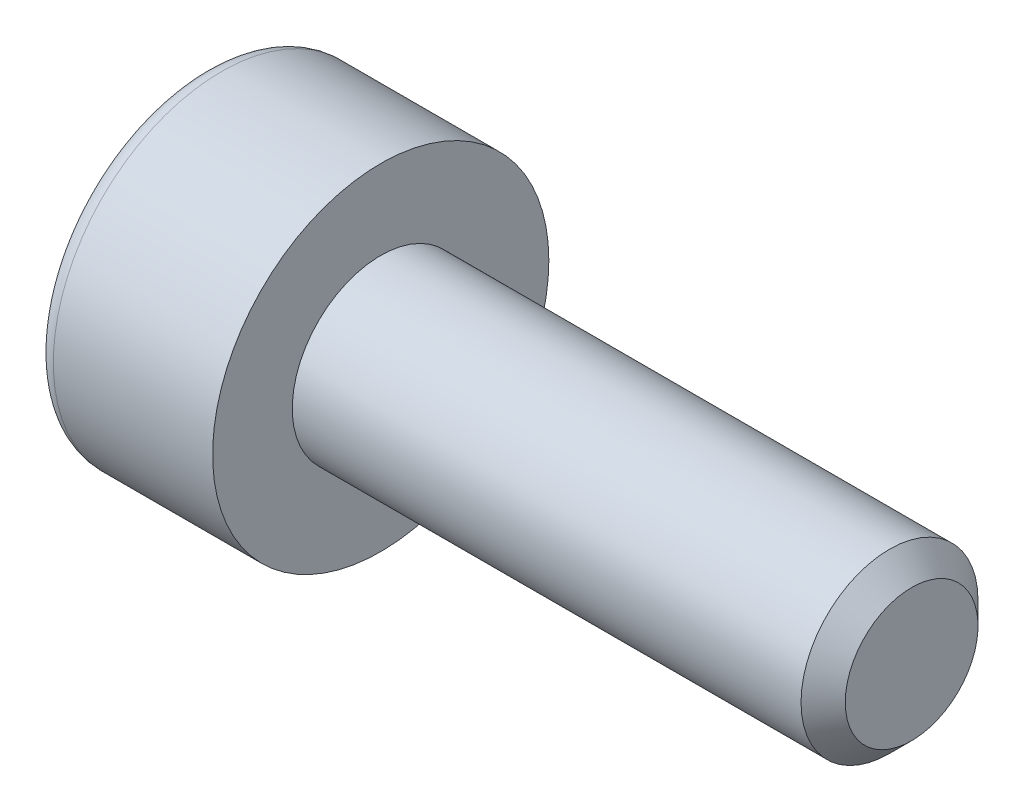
ISO-10303-21;
HEADER;
FILE_DESCRIPTION(('STEP AP214'),'2;1');
FILE_NAME('part.step','',(''),(''),'','','');
FILE_SCHEMA(('AUTOMOTIVE_DESIGN { 1 0 10303 214 1 1 1 1 }'));
ENDSEC;
DATA;
#1=APPLICATION_CONTEXT('core data for automotive mechanical design processes');
#2=APPLICATION_PROTOCOL_DEFINITION('international standard','automotive_design',2000,#1);
#3=PRODUCT_CONTEXT('',#1,'mechanical');
#4=PRODUCT('Part','Part','',(#3));
#5=PRODUCT_RELATED_PRODUCT_CATEGORY('part','',(#4));
#6=PRODUCT_DEFINITION_FORMATION('','',#4);
#7=PRODUCT_DEFINITION_CONTEXT('part definition',#1,'design');
#8=PRODUCT_DEFINITION('design','',#6,#7);
#9=PRODUCT_DEFINITION_SHAPE('','',#8);
#10=(LENGTH_UNIT() NAMED_UNIT(*) SI_UNIT(.MILLI.,.METRE.));
#11=(NAMED_UNIT(*) PLANE_ANGLE_UNIT() SI_UNIT($,.RADIAN.));
#12=(NAMED_UNIT(*) SI_UNIT($,.STERADIAN.) SOLID_ANGLE_UNIT());
#13=UNCERTAINTY_MEASURE_WITH_UNIT(LENGTH_MEASURE(1.E-05),#10,'distance_accuracy_value','');
#14=(GEOMETRIC_REPRESENTATION_CONTEXT(3) GLOBAL_UNCERTAINTY_ASSIGNED_CONTEXT((#13)) GLOBAL_UNIT_ASSIGNED_CONTEXT((#10,
#11,#12)) REPRESENTATION_CONTEXT('',''));
#15=CARTESIAN_POINT('',(0.,0.,0.));
#16=DIRECTION('',(0.,0.,1.));
#17=DIRECTION('',(1.,0.,0.));
#18=AXIS2_PLACEMENT_3D('',#15,#16,#17);
#19=CARTESIAN_POINT('',(-0.549999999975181,0.,0.));
#20=DIRECTION('',(-1.,0.,0.));
#21=DIRECTION('',(0.,0.,1.));
#22=AXIS2_PLACEMENT_3D('',#19,#20,#21);
#23=CONICAL_SURFACE('',#22,0.714285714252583,1.04719755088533);
#24=CARTESIAN_POINT('',(-0.13760695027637,0.,7.0082828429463E-12));
#25=VERTEX_POINT('',#24);
#26=VERTEX_LOOP('',#25);
#27=FACE_BOUND('',#26,.T.);
#28=CARTESIAN_POINT('',(-0.549999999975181,0.,0.));
#29=DIRECTION('',(-1.,0.,0.));
#30=DIRECTION('',(0.,0.,1.));
#31=AXIS2_PLACEMENT_3D('',#28,#29,#30);
#32=CIRCLE('',#31,0.714285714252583);
#33=CARTESIAN_POINT('',(-0.549999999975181,0.,0.714285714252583));
#34=VERTEX_POINT('',#33);
#35=EDGE_CURVE('E239',#34,#34,#32,.T.);
#36=ORIENTED_EDGE('',*,*,#35,.T.);
#37=EDGE_LOOP('',(#36));
#38=FACE_BOUND('',#37,.T.);
#39=ADVANCED_FACE('F17',(#27,#38),#23,.F.);
#40=CARTESIAN_POINT('',(-0.55,0.430125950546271,0.745));
#41=DIRECTION('',(0.,0.,1.));
#42=DIRECTION('',(1.,0.,0.));
#43=AXIS2_PLACEMENT_3D('',#40,#41,#42);
#44=PLANE('',#43);
#45=DIRECTION('',(1.,0.,0.));
#46=VECTOR('',#45,1.);
#47=CARTESIAN_POINT('',(-0.55,-0.430125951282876,0.744999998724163));
#48=LINE('',#47,#46);
#49=CARTESIAN_POINT('',(-0.55,-0.430125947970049,0.745000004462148));
#50=VERTEX_POINT('',#49);
#51=CARTESIAN_POINT('',(-1.99525190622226,-0.430125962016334,0.744999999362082));
#52=VERTEX_POINT('',#51);
#53=EDGE_CURVE('E231',#50,#52,#48,.F.);
#54=ORIENTED_EDGE('',*,*,#53,.T.);
#55=CARTESIAN_POINT('',(-1.87999999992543,0.,0.745));
#56=CARTESIAN_POINT('',(-1.87998385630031,-0.0228913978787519,0.745));
#57=CARTESIAN_POINT('',(-1.88105575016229,-0.0457651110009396,0.745));
#58=CARTESIAN_POINT('',(-1.88523402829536,-0.091286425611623,0.745));
#59=CARTESIAN_POINT('',(-1.88833675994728,-0.113934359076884,0.745));
#60=CARTESIAN_POINT('',(-1.90035941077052,-0.180676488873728,0.745));
#61=CARTESIAN_POINT('',(-1.91200287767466,-0.224290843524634,0.745));
#62=CARTESIAN_POINT('',(-1.93576731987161,-0.294788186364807,0.745));
#63=CARTESIAN_POINT('',(-1.9463278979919,-0.322236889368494,0.745));
#64=CARTESIAN_POINT('',(-1.96942771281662,-0.376627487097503,0.745));
#65=CARTESIAN_POINT('',(-1.98198614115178,-0.403561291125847,0.745));
#66=CARTESIAN_POINT('',(-1.99525191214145,-0.430125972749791,0.745));
#67=B_SPLINE_CURVE_WITH_KNOTS('',3,(#55,#56,#57,#58,#59,#60,#61,#62,#63,#64,#65,#66),
.UNSPECIFIED.,.F.,.F.,(4,2,2,2,2,4),(0.,0.0686183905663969,0.137113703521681,0.271967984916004,
0.360142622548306,0.449222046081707),.UNSPECIFIED.);
#68=CARTESIAN_POINT('',(-1.87999999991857,0.,0.744999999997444));
#69=VERTEX_POINT('',#68);
#70=EDGE_CURVE('E100',#69,#52,#67,.T.);
#71=ORIENTED_EDGE('',*,*,#70,.F.);
#72=CARTESIAN_POINT('',(-1.99525189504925,0.430125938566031,0.745));
#73=CARTESIAN_POINT('',(-1.98038788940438,0.400369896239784,0.745));
#74=CARTESIAN_POINT('',(-1.966402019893,0.370110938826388,0.745));
#75=CARTESIAN_POINT('',(-1.94080866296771,0.308386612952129,0.745));
#76=CARTESIAN_POINT('',(-1.92921687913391,0.276914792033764,0.745));
#77=CARTESIAN_POINT('',(-1.90953137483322,0.213872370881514,0.745));
#78=CARTESIAN_POINT('',(-1.90134578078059,0.182331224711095,0.745));
#79=CARTESIAN_POINT('',(-1.888734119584,0.118572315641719,0.745));
#80=CARTESIAN_POINT('',(-1.88429656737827,0.0863569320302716,0.745));
#81=CARTESIAN_POINT('',(-1.88130604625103,0.0450415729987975,0.745));
#82=CARTESIAN_POINT('',(-1.88081800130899,0.0360620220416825,0.745));
#83=CARTESIAN_POINT('',(-1.88016446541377,0.0180555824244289,0.745));
#84=CARTESIAN_POINT('',(-1.88000025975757,0.00902864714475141,0.745));
#85=CARTESIAN_POINT('',(-1.87999999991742,0.,0.745));
#86=B_SPLINE_CURVE_WITH_KNOTS('',3,(#72,#73,#74,#75,#76,#77,#78,#79,#80,#81,#82,#83,#84,#85),
.UNSPECIFIED.,.F.,.F.,(4,2,2,2,2,2,4),(0.,0.0998595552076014,0.200354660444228,
0.297929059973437,0.395203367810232,0.422177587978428,0.449258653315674),.UNSPECIFIED.);
#87=CARTESIAN_POINT('',(-1.99525190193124,0.43012594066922,0.745000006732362));
#88=VERTEX_POINT('',#87);
#89=EDGE_CURVE('E94',#88,#69,#86,.T.);
#90=ORIENTED_EDGE('',*,*,#89,.F.);
#91=DIRECTION('',(1.,0.,0.));
#92=VECTOR('',#91,1.);
#93=CARTESIAN_POINT('',(-0.55,0.430125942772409,0.745000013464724));
#94=LINE('',#93,#92);
#95=CARTESIAN_POINT('',(-0.55,0.430125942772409,0.745000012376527));
#96=VERTEX_POINT('',#95);
#97=EDGE_CURVE('E98',#88,#96,#94,.T.);
#98=ORIENTED_EDGE('',*,*,#97,.T.);
#99=DIRECTION('',(0.,1.,0.));
#100=VECTOR('',#99,1.);
#101=CARTESIAN_POINT('',(-0.55,0.,0.745000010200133));
#102=LINE('',#101,#100);
#103=EDGE_CURVE('E232',#96,#50,#102,.F.);
#104=ORIENTED_EDGE('',*,*,#103,.T.);
#105=EDGE_LOOP('',(#54,#71,#90,#98,#104));
#106=FACE_BOUND('',#105,.T.);
#107=ADVANCED_FACE('F97',(#106),#44,.F.);
#108=CARTESIAN_POINT('',(-0.55,0.,0.));
#109=DIRECTION('',(1.,0.,0.));
#110=DIRECTION('',(0.,0.,-1.));
#111=AXIS2_PLACEMENT_3D('',#108,#109,#110);
#112=PLANE('',#111);
#113=DIRECTION('',(0.,1.,0.));
#114=VECTOR('',#113,1.);
#115=CARTESIAN_POINT('',(-0.55,-0.430125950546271,-0.745));
#116=LINE('',#115,#114);
#117=CARTESIAN_POINT('',(-0.55,0.430125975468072,-0.744999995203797));
#118=VERTEX_POINT('',#117);
#119=CARTESIAN_POINT('',(-0.55,-0.430125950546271,-0.745));
#120=VERTEX_POINT('',#119);
#121=EDGE_CURVE('E222',#118,#120,#116,.F.);
#122=ORIENTED_EDGE('',*,*,#121,.T.);
#123=DIRECTION('',(0.,0.5,-0.866025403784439));
#124=VECTOR('',#123,1.);
#125=CARTESIAN_POINT('',(-0.55,-0.860251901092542,0.));
#126=LINE('',#125,#124);
#127=CARTESIAN_POINT('',(-0.55,-0.860251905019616,-6.81134989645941E-09));
#128=VERTEX_POINT('',#127);
#129=EDGE_CURVE('E229',#120,#128,#126,.F.);
#130=ORIENTED_EDGE('',*,*,#129,.T.);
#131=DIRECTION('',(0.,-0.5,-0.866025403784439));
#132=VECTOR('',#131,1.);
#133=CARTESIAN_POINT('',(-0.55,-0.430125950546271,0.745));
#134=LINE('',#133,#132);
#135=EDGE_CURVE('E113',#128,#50,#134,.F.);
#136=ORIENTED_EDGE('',*,*,#135,.T.);
#137=ORIENTED_EDGE('',*,*,#103,.F.);
#138=DIRECTION('',(0.,-0.5,0.866025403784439));
#139=VECTOR('',#138,1.);
#140=CARTESIAN_POINT('',(-0.55,0.860251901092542,0.));
#141=LINE('',#140,#139);
#142=CARTESIAN_POINT('',(-0.55,0.860251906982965,1.02003498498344E-08));
#143=VERTEX_POINT('',#142);
#144=EDGE_CURVE('E112',#96,#143,#141,.F.);
#145=ORIENTED_EDGE('',*,*,#144,.T.);
#146=DIRECTION('',(0.,0.5,0.866025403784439));
#147=VECTOR('',#146,1.);
#148=CARTESIAN_POINT('',(-0.55,0.430125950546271,-0.745));
#149=LINE('',#148,#147);
#150=EDGE_CURVE('E216',#143,#118,#149,.F.);
#151=ORIENTED_EDGE('',*,*,#150,.T.);
#152=EDGE_LOOP('',(#122,#130,#136,#137,#145,#151));
#153=FACE_BOUND('',#152,.T.);
#154=ORIENTED_EDGE('',*,*,#35,.F.);
#155=EDGE_LOOP('',(#154));
#156=FACE_BOUND('',#155,.T.);
#157=ADVANCED_FACE('F366',(#153,#156),#112,.F.);
#158=CARTESIAN_POINT('',(-0.55,-0.860251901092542,0.));
#159=DIRECTION('',(0.,-0.866025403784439,-0.5));
#160=DIRECTION('',(0.,0.5,-0.866025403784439));
#161=AXIS2_PLACEMENT_3D('',#158,#159,#160);
#162=PLANE('',#161);
#163=DIRECTION('',(-1.,0.,0.));
#164=VECTOR('',#163,1.);
#165=CARTESIAN_POINT('',(-0.55,-0.430125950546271,-0.745));
#166=LINE('',#165,#164);
#167=CARTESIAN_POINT('',(-1.99525190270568,-0.430125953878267,-0.745));
#168=VERTEX_POINT('',#167);
#169=EDGE_CURVE('E218',#120,#168,#166,.T.);
#170=ORIENTED_EDGE('',*,*,#169,.T.);
#171=CARTESIAN_POINT('',(-1.99525186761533,-0.430125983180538,-0.744999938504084));
#172=CARTESIAN_POINT('',(-1.98048246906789,-0.444909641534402,-0.719393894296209));
#173=CARTESIAN_POINT('',(-1.96658057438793,-0.459940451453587,-0.693359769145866));
#174=CARTESIAN_POINT('',(-1.94112679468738,-0.490589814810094,-0.640273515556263));
#175=CARTESIAN_POINT('',(-1.92958906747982,-0.506211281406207,-0.613216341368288));
#176=CARTESIAN_POINT('',(-1.90982500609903,-0.537711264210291,-0.558656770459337));
#177=CARTESIAN_POINT('',(-1.90154900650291,-0.553581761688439,-0.531168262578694));
#178=CARTESIAN_POINT('',(-1.88879772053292,-0.585671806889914,-0.475586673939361));
#179=CARTESIAN_POINT('',(-1.88431292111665,-0.601890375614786,-0.447495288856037));
#180=CARTESIAN_POINT('',(-1.8802677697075,-0.629845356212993,-0.399075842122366));
#181=CARTESIAN_POINT('',(-1.87967004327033,-0.641545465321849,-0.378810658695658));
#182=CARTESIAN_POINT('',(-1.88067744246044,-0.664922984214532,-0.338319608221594));
#183=CARTESIAN_POINT('',(-1.88228305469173,-0.676600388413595,-0.318093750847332));
#184=CARTESIAN_POINT('',(-1.89029877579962,-0.711465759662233,-0.257705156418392));
#185=CARTESIAN_POINT('',(-1.89990867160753,-0.734480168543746,-0.217843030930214));
#186=CARTESIAN_POINT('',(-1.92308947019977,-0.774855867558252,-0.147910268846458));
#187=CARTESIAN_POINT('',(-1.9354410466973,-0.792407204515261,-0.11751046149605));
#188=CARTESIAN_POINT('',(-1.96326253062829,-0.826822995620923,-0.0579005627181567));
#189=CARTESIAN_POINT('',(-1.9787222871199,-0.843689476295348,-0.028686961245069));
#190=CARTESIAN_POINT('',(-1.99525185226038,-0.860251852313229,-8.44882484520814E-08));
#191=B_SPLINE_CURVE_WITH_KNOTS('',3,(#171,#172,#173,#174,#175,#176,#177,#178,#179,#180,#181,
#182,#183,#184,#185,#186,#187,#188,#189,#190),.UNSPECIFIED.,.F.,.F.,(4,2,2,2,2,2,2,2,2,4),(0.,
0.0992212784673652,0.199020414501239,0.297235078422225,0.395202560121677,0.465324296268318,
0.535461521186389,0.675775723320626,0.787264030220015,0.898393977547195),.UNSPECIFIED.);
#192=CARTESIAN_POINT('',(-1.9952518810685,-0.860251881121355,-4.98971380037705E-08));
#193=VERTEX_POINT('',#192);
#194=EDGE_CURVE('E225',#168,#193,#191,.T.);
#195=ORIENTED_EDGE('',*,*,#194,.T.);
#196=DIRECTION('',(1.,0.,0.));
#197=VECTOR('',#196,1.);
#198=CARTESIAN_POINT('',(-0.55,-0.860251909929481,-1.530602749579E-08));
#199=LINE('',#198,#197);
#200=EDGE_CURVE('E243',#193,#128,#199,.T.);
#201=ORIENTED_EDGE('',*,*,#200,.T.);
#202=ORIENTED_EDGE('',*,*,#129,.F.);
#203=EDGE_LOOP('',(#170,#195,#201,#202));
#204=FACE_BOUND('',#203,.T.);
#205=ADVANCED_FACE('F359',(#204),#162,.F.);
#206=CARTESIAN_POINT('',(-0.55,-0.430125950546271,0.745));
#207=DIRECTION('',(0.,-0.866025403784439,0.5));
#208=DIRECTION('',(0.,-0.5,-0.866025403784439));
#209=AXIS2_PLACEMENT_3D('',#206,#207,#208);
#210=PLANE('',#209);
#211=ORIENTED_EDGE('',*,*,#200,.F.);
#212=CARTESIAN_POINT('',(-1.99525192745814,-0.860251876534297,-2.95558073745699E-08));
#213=CARTESIAN_POINT('',(-1.98048251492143,-0.845468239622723,0.0256060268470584));
#214=CARTESIAN_POINT('',(-1.96658061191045,-0.830437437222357,0.0516401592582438));
#215=CARTESIAN_POINT('',(-1.94112682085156,-0.799788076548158,0.104726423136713));
#216=CARTESIAN_POINT('',(-1.92958909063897,-0.784166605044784,0.131783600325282));
#217=CARTESIAN_POINT('',(-1.90982502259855,-0.752666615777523,0.18634317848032));
#218=CARTESIAN_POINT('',(-1.90154901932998,-0.736796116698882,0.213831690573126));
#219=CARTESIAN_POINT('',(-1.88879772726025,-0.704706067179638,0.269413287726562));
#220=CARTESIAN_POINT('',(-1.88431292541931,-0.688487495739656,0.297504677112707));
#221=CARTESIAN_POINT('',(-1.88026777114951,-0.660532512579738,0.34592412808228));
#222=CARTESIAN_POINT('',(-1.87967004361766,-0.648832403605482,0.366189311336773));
#223=CARTESIAN_POINT('',(-1.88067744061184,-0.625454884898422,0.406680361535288));
#224=CARTESIAN_POINT('',(-1.88228305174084,-0.613777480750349,0.426906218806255));
#225=CARTESIAN_POINT('',(-1.89029876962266,-0.578912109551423,0.487294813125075));
#226=CARTESIAN_POINT('',(-1.89990866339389,-0.555897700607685,0.527156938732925));
#227=CARTESIAN_POINT('',(-1.92308946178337,-0.515521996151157,0.59708971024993));
#228=CARTESIAN_POINT('',(-1.93544104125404,-0.497970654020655,0.627489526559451));
#229=CARTESIAN_POINT('',(-1.96326253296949,-0.463554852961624,0.687099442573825));
#230=CARTESIAN_POINT('',(-1.97872229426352,-0.446688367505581,0.716313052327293));
#231=CARTESIAN_POINT('',(-1.99525186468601,-0.430125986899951,0.74499993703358));
#232=B_SPLINE_CURVE_WITH_KNOTS('',3,(#212,#213,#214,#215,#216,#217,#218,#219,#220,#221,#222,
#223,#224,#225,#226,#227,#228,#229,#230,#231),.UNSPECIFIED.,.F.,.F.,(4,2,2,2,2,2,2,2,2,4),(0.,
0.099221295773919,0.199020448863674,0.297235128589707,0.395202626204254,0.465324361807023,
0.535461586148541,0.675775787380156,0.787264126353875,0.898394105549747),.UNSPECIFIED.);
#233=EDGE_CURVE('E405',#193,#52,#232,.T.);
#234=ORIENTED_EDGE('',*,*,#233,.T.);
#235=ORIENTED_EDGE('',*,*,#53,.F.);
#236=ORIENTED_EDGE('',*,*,#135,.F.);
#237=EDGE_LOOP('',(#211,#234,#235,#236));
#238=FACE_BOUND('',#237,.T.);
#239=ADVANCED_FACE('F175',(#238),#210,.F.);
#240=CARTESIAN_POINT('',(-0.55,0.860251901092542,0.));
#241=DIRECTION('',(0.,0.866025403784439,0.5));
#242=DIRECTION('',(0.,-0.5,0.866025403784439));
#243=AXIS2_PLACEMENT_3D('',#240,#241,#242);
#244=PLANE('',#243);
#245=ORIENTED_EDGE('',*,*,#97,.F.);
#246=CARTESIAN_POINT('',(-1.9952519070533,0.430125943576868,0.745000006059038));
#247=CARTESIAN_POINT('',(-1.98048250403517,0.444909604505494,0.719393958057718));
#248=CARTESIAN_POINT('',(-1.96658060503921,0.459940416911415,0.693359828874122));
#249=CARTESIAN_POINT('',(-1.94112681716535,0.490589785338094,0.640273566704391));
#250=CARTESIAN_POINT('',(-1.92958908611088,0.506211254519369,0.613216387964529));
#251=CARTESIAN_POINT('',(-1.90982501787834,0.537711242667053,0.558656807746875));
#252=CARTESIAN_POINT('',(-1.90154901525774,0.553581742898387,0.531168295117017));
#253=CARTESIAN_POINT('',(-1.88879772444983,0.585671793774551,0.475586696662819));
#254=CARTESIAN_POINT('',(-1.88431292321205,0.601890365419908,0.447495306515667));
#255=CARTESIAN_POINT('',(-1.88026777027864,0.629845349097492,0.399075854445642));
#256=CARTESIAN_POINT('',(-1.8796700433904,0.641545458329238,0.378810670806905));
#257=CARTESIAN_POINT('',(-1.88067744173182,0.664922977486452,0.338319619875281));
#258=CARTESIAN_POINT('',(-1.88228305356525,0.676600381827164,0.318093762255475));
#259=CARTESIAN_POINT('',(-1.89029877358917,0.711465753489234,0.257705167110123));
#260=CARTESIAN_POINT('',(-1.8999086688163,0.734480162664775,0.217843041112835));
#261=CARTESIAN_POINT('',(-1.92308946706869,0.774855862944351,0.147910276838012));
#262=CARTESIAN_POINT('',(-1.9354410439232,0.792407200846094,0.117510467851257));
#263=CARTESIAN_POINT('',(-1.9632625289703,0.826822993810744,0.0579005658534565));
#264=CARTESIAN_POINT('',(-1.97872228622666,0.84368947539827,0.0286869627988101));
#265=CARTESIAN_POINT('',(-1.99525185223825,0.86025185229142,8.45260231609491E-08));
#266=B_SPLINE_CURVE_WITH_KNOTS('',3,(#246,#247,#248,#249,#250,#251,#252,#253,#254,#255,#256,
#257,#258,#259,#260,#261,#262,#263,#264,#265),.UNSPECIFIED.,.F.,.F.,(4,2,2,2,2,2,2,2,2,4),(0.,
0.099221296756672,0.199020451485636,0.297235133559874,0.395202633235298,0.465324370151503,
0.535461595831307,0.675775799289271,0.787264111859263,0.898394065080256),.UNSPECIFIED.);
#267=CARTESIAN_POINT('',(-1.99525188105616,0.86025188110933,4.99140848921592E-08));
#268=VERTEX_POINT('',#267);
#269=EDGE_CURVE('E110',#88,#268,#266,.T.);
#270=ORIENTED_EDGE('',*,*,#269,.T.);
#271=DIRECTION('',(1.,0.,0.));
#272=VECTOR('',#271,1.);
#273=CARTESIAN_POINT('',(-0.55,0.860251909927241,1.53021465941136E-08));
#274=LINE('',#273,#272);
#275=EDGE_CURVE('E219',#268,#143,#274,.T.);
#276=ORIENTED_EDGE('',*,*,#275,.T.);
#277=ORIENTED_EDGE('',*,*,#144,.F.);
#278=EDGE_LOOP('',(#245,#270,#276,#277));
#279=FACE_BOUND('',#278,.T.);
#280=ADVANCED_FACE('F108',(#279),#244,.F.);
#281=CARTESIAN_POINT('',(-0.55,0.430125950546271,-0.745));
#282=DIRECTION('',(0.,0.866025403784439,-0.5));
#283=DIRECTION('',(0.,0.5,0.866025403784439));
#284=AXIS2_PLACEMENT_3D('',#281,#282,#283);
#285=PLANE('',#284);
#286=ORIENTED_EDGE('',*,*,#275,.F.);
#287=CARTESIAN_POINT('',(-1.99525192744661,0.860251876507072,2.95313026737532E-08));
#288=CARTESIAN_POINT('',(-1.98048251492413,0.845468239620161,-0.0256060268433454));
#289=CARTESIAN_POINT('',(-1.96658061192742,0.830437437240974,-0.0516401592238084));
#290=CARTESIAN_POINT('',(-1.94112682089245,0.799788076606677,-0.104726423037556));
#291=CARTESIAN_POINT('',(-1.9295890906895,0.784166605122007,-0.131783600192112));
#292=CARTESIAN_POINT('',(-1.90982502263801,0.752666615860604,-0.186343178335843));
#293=CARTESIAN_POINT('',(-1.90154901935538,0.736796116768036,-0.213831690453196));
#294=CARTESIAN_POINT('',(-1.88879772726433,0.704706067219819,-0.269413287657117));
#295=CARTESIAN_POINT('',(-1.8843129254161,0.688487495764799,-0.297504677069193));
#296=CARTESIAN_POINT('',(-1.88026777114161,0.660532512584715,-0.345924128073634));
#297=CARTESIAN_POINT('',(-1.87967004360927,0.648832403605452,-0.366189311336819));
#298=CARTESIAN_POINT('',(-1.88067744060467,0.625454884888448,-0.40668036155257));
#299=CARTESIAN_POINT('',(-1.8822830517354,0.61377748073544,-0.426906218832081));
#300=CARTESIAN_POINT('',(-1.89029876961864,0.578912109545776,-0.487294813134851));
#301=CARTESIAN_POINT('',(-1.89990866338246,0.555897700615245,-0.52715693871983));
#302=CARTESIAN_POINT('',(-1.92308945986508,0.515521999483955,-0.597089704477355));
#303=CARTESIAN_POINT('',(-1.93544103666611,0.497970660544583,-0.627489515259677));
#304=CARTESIAN_POINT('',(-1.96326252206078,0.463554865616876,-0.687099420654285));
#305=CARTESIAN_POINT('',(-1.97872227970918,0.446688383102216,-0.716313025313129));
#306=CARTESIAN_POINT('',(-1.99525184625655,0.430126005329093,-0.744999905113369));
#307=B_SPLINE_CURVE_WITH_KNOTS('',3,(#287,#288,#289,#290,#291,#292,#293,#294,#295,#296,#297,
#298,#299,#300,#301,#302,#303,#304,#305,#306),.UNSPECIFIED.,.F.,.F.,(4,2,2,2,2,2,2,2,2,4),(0.,
0.0992212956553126,0.199020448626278,0.297235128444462,0.395202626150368,0.46532436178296,
0.535461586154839,0.675775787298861,0.78726410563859,0.898394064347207),.UNSPECIFIED.);
#308=CARTESIAN_POINT('',(-1.99525188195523,0.430125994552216,-0.744999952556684));
#309=VERTEX_POINT('',#308);
#310=EDGE_CURVE('E118',#268,#309,#307,.T.);
#311=ORIENTED_EDGE('',*,*,#310,.T.);
#312=DIRECTION('',(-1.,0.,0.));
#313=VECTOR('',#312,1.);
#314=CARTESIAN_POINT('',(-0.55,0.430125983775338,-0.745));
#315=LINE('',#314,#313);
#316=EDGE_CURVE('E226',#309,#118,#315,.F.);
#317=ORIENTED_EDGE('',*,*,#316,.T.);
#318=ORIENTED_EDGE('',*,*,#150,.F.);
#319=EDGE_LOOP('',(#286,#311,#317,#318));
#320=FACE_BOUND('',#319,.T.);
#321=ADVANCED_FACE('F164',(#320),#285,.F.);
#322=CARTESIAN_POINT('',(-0.55,-0.430125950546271,-0.745));
#323=DIRECTION('',(0.,0.,-1.));
#324=DIRECTION('',(-1.,0.,0.));
#325=AXIS2_PLACEMENT_3D('',#322,#323,#324);
#326=PLANE('',#325);
#327=ORIENTED_EDGE('',*,*,#316,.F.);
#328=CARTESIAN_POINT('',(-1.99525193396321,0.430125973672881,-0.744999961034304));
#329=CARTESIAN_POINT('',(-1.98038791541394,0.400369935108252,-0.744999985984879));
#330=CARTESIAN_POINT('',(-1.96640203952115,0.370110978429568,-0.744999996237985));
#331=CARTESIAN_POINT('',(-1.94080867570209,0.308386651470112,-0.745000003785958));
#332=CARTESIAN_POINT('',(-1.92921689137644,0.27691482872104,-0.745000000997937));
#333=CARTESIAN_POINT('',(-1.9095313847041,0.213872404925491,-0.744999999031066));
#334=CARTESIAN_POINT('',(-1.90134578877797,0.182331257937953,-0.744999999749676));
#335=CARTESIAN_POINT('',(-1.88873412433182,0.118572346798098,-0.745000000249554));
#336=CARTESIAN_POINT('',(-1.88429657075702,0.0863569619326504,-0.745000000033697));
#337=CARTESIAN_POINT('',(-1.88130604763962,0.0450415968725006,-0.744999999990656));
#338=CARTESIAN_POINT('',(-1.88081800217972,0.0360620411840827,-0.744999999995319));
#339=CARTESIAN_POINT('',(-1.8801644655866,0.0180555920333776,-0.7450000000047));
#340=CARTESIAN_POINT('',(-1.8800002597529,0.00902865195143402,-0.745000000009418));
#341=CARTESIAN_POINT('',(-1.87999999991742,0.,-0.745));
#342=B_SPLINE_CURVE_WITH_KNOTS('',3,(#328,#329,#330,#331,#332,#333,#334,#335,#336,#337,#338,
#339,#340,#341),.UNSPECIFIED.,.F.,.F.,(4,2,2,2,2,2,4),(0.,0.0998595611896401,0.200354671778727,
0.297929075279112,0.395203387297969,0.422177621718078,0.449258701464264),.UNSPECIFIED.);
#343=CARTESIAN_POINT('',(-1.87999999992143,0.,-0.745));
#344=VERTEX_POINT('',#343);
#345=EDGE_CURVE('E121',#309,#344,#342,.T.);
#346=ORIENTED_EDGE('',*,*,#345,.T.);
#347=CARTESIAN_POINT('',(-1.87999999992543,0.,-0.745));
#348=CARTESIAN_POINT('',(-1.87998385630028,-0.0228913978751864,-0.745));
#349=CARTESIAN_POINT('',(-1.88105575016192,-0.0457651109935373,-0.745));
#350=CARTESIAN_POINT('',(-1.88523402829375,-0.0912864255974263,-0.745));
#351=CARTESIAN_POINT('',(-1.88833675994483,-0.113934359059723,-0.745));
#352=CARTESIAN_POINT('',(-1.90035941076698,-0.180676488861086,-0.745));
#353=CARTESIAN_POINT('',(-1.91200287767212,-0.224290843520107,-0.745));
#354=CARTESIAN_POINT('',(-1.93576731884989,-0.29478818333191,-0.745));
#355=CARTESIAN_POINT('',(-1.94632789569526,-0.322236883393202,-0.745));
#356=CARTESIAN_POINT('',(-1.96942770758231,-0.376627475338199,-0.745));
#357=CARTESIAN_POINT('',(-1.98198613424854,-0.403561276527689,-0.745));
#358=CARTESIAN_POINT('',(-1.99525190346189,-0.43012595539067,-0.745));
#359=B_SPLINE_CURVE_WITH_KNOTS('',3,(#347,#348,#349,#350,#351,#352,#353,#354,#355,#356,#357,
#358),.UNSPECIFIED.,.F.,.F.,(4,2,2,2,2,4),(0.,0.0686183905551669,0.137113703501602,
0.271967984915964,0.36014261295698,0.449222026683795),.UNSPECIFIED.);
#360=EDGE_CURVE('E123',#344,#168,#359,.T.);
#361=ORIENTED_EDGE('',*,*,#360,.T.);
#362=ORIENTED_EDGE('',*,*,#169,.F.);
#363=ORIENTED_EDGE('',*,*,#121,.F.);
#364=EDGE_LOOP('',(#327,#346,#361,#362,#363));
#365=FACE_BOUND('',#364,.T.);
#366=ADVANCED_FACE('F161',(#365),#326,.F.);
#367=CARTESIAN_POINT('',(-1.99999999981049,0.,0.));
#368=DIRECTION('',(-1.,0.,0.));
#369=DIRECTION('',(0.,0.,1.));
#370=AXIS2_PLACEMENT_3D('',#367,#368,#369);
#371=CONICAL_SURFACE('',#370,0.864999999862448,0.785398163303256);
#372=DIRECTION('',(0.707106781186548,0.,0.707106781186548));
#373=VECTOR('',#372,1.);
#374=CARTESIAN_POINT('',(-499000.,6.11077180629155E-11,-498998.865));
#375=LINE('',#374,#373);
#376=CARTESIAN_POINT('',(-1.99999999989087,0.,-0.864999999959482));
#377=VERTEX_POINT('',#376);
#378=EDGE_CURVE('E158',#344,#377,#375,.F.);
#379=ORIENTED_EDGE('',*,*,#378,.T.);
#380=CARTESIAN_POINT('',(-1.99999999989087,0.,0.));
#381=DIRECTION('',(-1.,0.,0.));
#382=DIRECTION('',(0.,0.,1.));
#383=AXIS2_PLACEMENT_3D('',#380,#381,#382);
#384=CIRCLE('',#383,0.864999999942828);
#385=CARTESIAN_POINT('',(-1.99999999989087,0.,0.864999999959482));
#386=VERTEX_POINT('',#385);
#387=EDGE_CURVE('E159',#386,#377,#384,.F.);
#388=ORIENTED_EDGE('',*,*,#387,.F.);
#389=DIRECTION('',(0.707106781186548,0.,-0.707106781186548));
#390=VECTOR('',#389,1.);
#391=CARTESIAN_POINT('',(-499000.,0.,498998.865));
#392=LINE('',#391,#390);
#393=EDGE_CURVE('E119',#386,#69,#392,.T.);
#394=ORIENTED_EDGE('',*,*,#393,.T.);
#395=ORIENTED_EDGE('',*,*,#70,.T.);
#396=ORIENTED_EDGE('',*,*,#233,.F.);
#397=ORIENTED_EDGE('',*,*,#194,.F.);
#398=ORIENTED_EDGE('',*,*,#360,.F.);
#399=EDGE_LOOP('',(#379,#388,#394,#395,#396,#397,#398));
#400=FACE_BOUND('',#399,.T.);
#401=ADVANCED_FACE('F148',(#400),#371,.F.);
#402=CARTESIAN_POINT('',(-1.99999999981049,0.,0.));
#403=DIRECTION('',(-1.,0.,0.));
#404=DIRECTION('',(0.,0.,1.));
#405=AXIS2_PLACEMENT_3D('',#402,#403,#404);
#406=CONICAL_SURFACE('',#405,0.864999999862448,0.78539816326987);
#407=ORIENTED_EDGE('',*,*,#345,.F.);
#408=ORIENTED_EDGE('',*,*,#310,.F.);
#409=ORIENTED_EDGE('',*,*,#269,.F.);
#410=ORIENTED_EDGE('',*,*,#89,.T.);
#411=ORIENTED_EDGE('',*,*,#393,.F.);
#412=CARTESIAN_POINT('',(-1.99999999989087,0.,0.));
#413=DIRECTION('',(-1.,0.,0.));
#414=DIRECTION('',(0.,0.,1.));
#415=AXIS2_PLACEMENT_3D('',#412,#413,#414);
#416=CIRCLE('',#415,0.864999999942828);
#417=EDGE_CURVE('E201',#377,#386,#416,.F.);
#418=ORIENTED_EDGE('',*,*,#417,.F.);
#419=ORIENTED_EDGE('',*,*,#378,.F.);
#420=EDGE_LOOP('',(#407,#408,#409,#410,#411,#418,#419));
#421=FACE_BOUND('',#420,.T.);
#422=ADVANCED_FACE('F117',(#421),#406,.F.);
#423=CARTESIAN_POINT('',(-2.,1.2825,0.));
#424=DIRECTION('',(-1.,0.,0.));
#425=DIRECTION('',(0.,0.,1.));
#426=AXIS2_PLACEMENT_3D('',#423,#424,#425);
#427=PLANE('',#426);
#428=CARTESIAN_POINT('',(-2.00000000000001,0.,0.));
#429=DIRECTION('',(1.,0.,0.));
#430=DIRECTION('',(0.,0.,-1.));
#431=AXIS2_PLACEMENT_3D('',#428,#429,#430);
#432=CIRCLE('',#431,1.70000000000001);
#433=CARTESIAN_POINT('',(-2.,0.,-1.70000000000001));
#434=VERTEX_POINT('',#433);
#435=CARTESIAN_POINT('',(-2.,1.7,0.));
#436=VERTEX_POINT('',#435);
#437=EDGE_CURVE('E206',#434,#436,#432,.T.);
#438=ORIENTED_EDGE('',*,*,#437,.F.);
#439=CARTESIAN_POINT('',(-2.00000000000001,0.,0.));
#440=DIRECTION('',(1.,0.,0.));
#441=DIRECTION('',(0.,0.,1.));
#442=AXIS2_PLACEMENT_3D('',#439,#440,#441);
#443=CIRCLE('',#442,1.70000000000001);
#444=CARTESIAN_POINT('',(-2.,0.,1.70000000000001));
#445=VERTEX_POINT('',#444);
#446=EDGE_CURVE('E38',#445,#434,#443,.T.);
#447=ORIENTED_EDGE('',*,*,#446,.F.);
#448=CARTESIAN_POINT('',(-2.00000000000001,0.,0.));
#449=DIRECTION('',(1.,0.,0.));
#450=DIRECTION('',(0.,1.,0.));
#451=AXIS2_PLACEMENT_3D('',#448,#449,#450);
#452=CIRCLE('',#451,1.7);
#453=EDGE_CURVE('E271',#436,#445,#452,.T.);
#454=ORIENTED_EDGE('',*,*,#453,.F.);
#455=EDGE_LOOP('',(#438,#447,#454));
#456=FACE_BOUND('',#455,.T.);
#457=ORIENTED_EDGE('',*,*,#387,.T.);
#458=ORIENTED_EDGE('',*,*,#417,.T.);
#459=EDGE_LOOP('',(#457,#458));
#460=FACE_BOUND('',#459,.T.);
#461=ADVANCED_FACE('F147',(#456,#460),#427,.T.);
#462=CARTESIAN_POINT('',(-1.80000000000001,0.,0.));
#463=DIRECTION('',(-1.,0.,0.));
#464=DIRECTION('',(0.,0.,1.));
#465=AXIS2_PLACEMENT_3D('',#462,#463,#464);
#466=TOROIDAL_SURFACE('',#465,1.70000000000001,0.199999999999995);
#467=ORIENTED_EDGE('',*,*,#446,.T.);
#468=ORIENTED_EDGE('',*,*,#437,.T.);
#469=ORIENTED_EDGE('',*,*,#453,.T.);
#470=EDGE_LOOP('',(#467,#468,#469));
#471=FACE_BOUND('',#470,.T.);
#472=CARTESIAN_POINT('',(-1.8,0.,0.));
#473=DIRECTION('',(1.,0.,0.));
#474=DIRECTION('',(0.,0.,-1.));
#475=AXIS2_PLACEMENT_3D('',#472,#473,#474);
#476=CIRCLE('',#475,1.9);
#477=CARTESIAN_POINT('',(-1.8,0.,-1.9));
#478=VERTEX_POINT('',#477);
#479=EDGE_CURVE('E198',#478,#478,#476,.T.);
#480=ORIENTED_EDGE('',*,*,#479,.F.);
#481=EDGE_LOOP('',(#480));
#482=FACE_BOUND('',#481,.T.);
#483=ADVANCED_FACE('F300',(#471,#482),#466,.T.);
#484=CARTESIAN_POINT('',(-0.9,0.,0.));
#485=DIRECTION('',(1.,0.,0.));
#486=DIRECTION('',(0.,0.,-1.));
#487=AXIS2_PLACEMENT_3D('',#484,#485,#486);
#488=CYLINDRICAL_SURFACE('',#487,1.9);
#489=CARTESIAN_POINT('',(0.,0.,0.));
#490=DIRECTION('',(1.,0.,0.));
#491=DIRECTION('',(0.,0.,-1.));
#492=AXIS2_PLACEMENT_3D('',#489,#490,#491);
#493=CIRCLE('',#492,1.9);
#494=CARTESIAN_POINT('',(0.,0.,-1.9));
#495=VERTEX_POINT('',#494);
#496=EDGE_CURVE('E194',#495,#495,#493,.T.);
#497=ORIENTED_EDGE('',*,*,#496,.F.);
#498=EDGE_LOOP('',(#497));
#499=FACE_BOUND('',#498,.T.);
#500=ORIENTED_EDGE('',*,*,#479,.T.);
#501=EDGE_LOOP('',(#500));
#502=FACE_BOUND('',#501,.T.);
#503=ADVANCED_FACE('F304',(#499,#502),#488,.T.);
#504=CARTESIAN_POINT('',(6.,0.,0.));
#505=DIRECTION('',(1.,0.,0.));
#506=DIRECTION('',(0.,0.,-1.));
#507=AXIS2_PLACEMENT_3D('',#504,#505,#506);
#508=PLANE('',#507);
#509=CARTESIAN_POINT('',(5.99999999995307,0.,0.));
#510=DIRECTION('',(-1.,0.,0.));
#511=DIRECTION('',(0.,0.,1.));
#512=AXIS2_PLACEMENT_3D('',#509,#510,#511);
#513=CIRCLE('',#512,0.749999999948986);
#514=CARTESIAN_POINT('',(5.99999999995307,0.,0.749999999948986));
#515=VERTEX_POINT('',#514);
#516=EDGE_CURVE('E192',#515,#515,#513,.T.);
#517=ORIENTED_EDGE('',*,*,#516,.F.);
#518=EDGE_LOOP('',(#517));
#519=FACE_BOUND('',#518,.T.);
#520=ADVANCED_FACE('F323',(#519),#508,.T.);
#521=CARTESIAN_POINT('',(0.,1.6,0.));
#522=DIRECTION('',(1.,0.,0.));
#523=DIRECTION('',(0.,1.,0.));
#524=AXIS2_PLACEMENT_3D('',#521,#522,#523);
#525=PLANE('',#524);
#526=ORIENTED_EDGE('',*,*,#496,.T.);
#527=EDGE_LOOP('',(#526));
#528=FACE_BOUND('',#527,.T.);
#529=CARTESIAN_POINT('',(0.,0.,0.));
#530=DIRECTION('',(1.,0.,0.));
#531=DIRECTION('',(0.,0.,-1.));
#532=AXIS2_PLACEMENT_3D('',#529,#530,#531);
#533=CIRCLE('',#532,1.);
#534=CARTESIAN_POINT('',(0.,0.,-1.));
#535=VERTEX_POINT('',#534);
#536=EDGE_CURVE('E29',#535,#535,#533,.T.);
#537=ORIENTED_EDGE('',*,*,#536,.F.);
#538=EDGE_LOOP('',(#537));
#539=FACE_BOUND('',#538,.T.);
#540=ADVANCED_FACE('F183',(#528,#539),#525,.T.);
#541=CARTESIAN_POINT('',(5.75000000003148,0.,0.));
#542=DIRECTION('',(-1.,0.,0.));
#543=DIRECTION('',(0.,0.,1.));
#544=AXIS2_PLACEMENT_3D('',#541,#542,#543);
#545=CONICAL_SURFACE('',#544,0.999999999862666,0.785398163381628);
#546=CARTESIAN_POINT('',(5.75,0.,0.));
#547=DIRECTION('',(1.,0.,0.));
#548=DIRECTION('',(0.,0.,-1.));
#549=AXIS2_PLACEMENT_3D('',#546,#547,#548);
#550=CIRCLE('',#549,1.);
#551=CARTESIAN_POINT('',(5.75,0.,-1.));
#552=VERTEX_POINT('',#551);
#553=EDGE_CURVE('E11',#552,#552,#550,.F.);
#554=ORIENTED_EDGE('',*,*,#553,.F.);
#555=EDGE_LOOP('',(#554));
#556=FACE_BOUND('',#555,.T.);
#557=ORIENTED_EDGE('',*,*,#516,.T.);
#558=EDGE_LOOP('',(#557));
#559=FACE_BOUND('',#558,.T.);
#560=ADVANCED_FACE('F177',(#556,#559),#545,.T.);
#561=CARTESIAN_POINT('',(1.63225,0.,0.));
#562=DIRECTION('',(1.,0.,0.));
#563=DIRECTION('',(0.,0.,-1.));
#564=AXIS2_PLACEMENT_3D('',#561,#562,#563);
#565=CYLINDRICAL_SURFACE('',#564,1.);
#566=ORIENTED_EDGE('',*,*,#536,.T.);
#567=EDGE_LOOP('',(#566));
#568=FACE_BOUND('',#567,.T.);
#569=ORIENTED_EDGE('',*,*,#553,.T.);
#570=EDGE_LOOP('',(#569));
#571=FACE_BOUND('',#570,.T.);
#572=ADVANCED_FACE('F19',(#568,#571),#565,.T.);
#573=CLOSED_SHELL('',(#39,#107,#157,#205,#239,#280,#321,#366,#401,#422,#461,#483,#503,#520,#540,
#560,#572));
#574=MANIFOLD_SOLID_BREP('B1',#573);
#575=ADVANCED_BREP_SHAPE_REPRESENTATION('',(#18,#574),#14);
#576=SHAPE_DEFINITION_REPRESENTATION(#9,#575);
ENDSEC;
END-ISO-10303-21;
